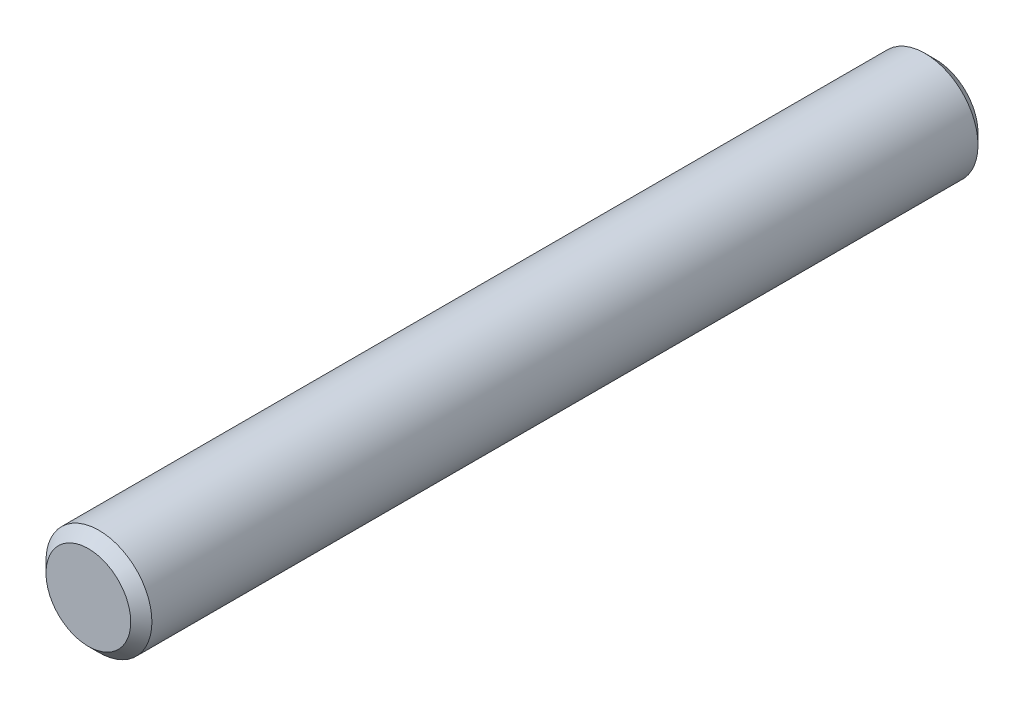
from build123d import *

# Parameters (mm, degrees)
ESQUISSE1_R      = 2.5
EXTRUSION1_DEPTH = 20
CHANFREIN1_SIZE  = 0.5


with BuildPart() as part:
    # Esquisse1 → Extrusion1 (new, symmetric)
    with BuildSketch(Plane.XY):
        Circle(ESQUISSE1_R)
    extrude(amount=EXTRUSION1_DEPTH, both=True)

    # Chanfrein1
    chanfrein1_edges = [part.edges().sort_by_distance(p)[0] for p in [
        (-2.5, 0, -20),
        (-2.5, 0, 20),
    ]]
    chamfer(chanfrein1_edges, length=CHANFREIN1_SIZE)


solid = part.part
